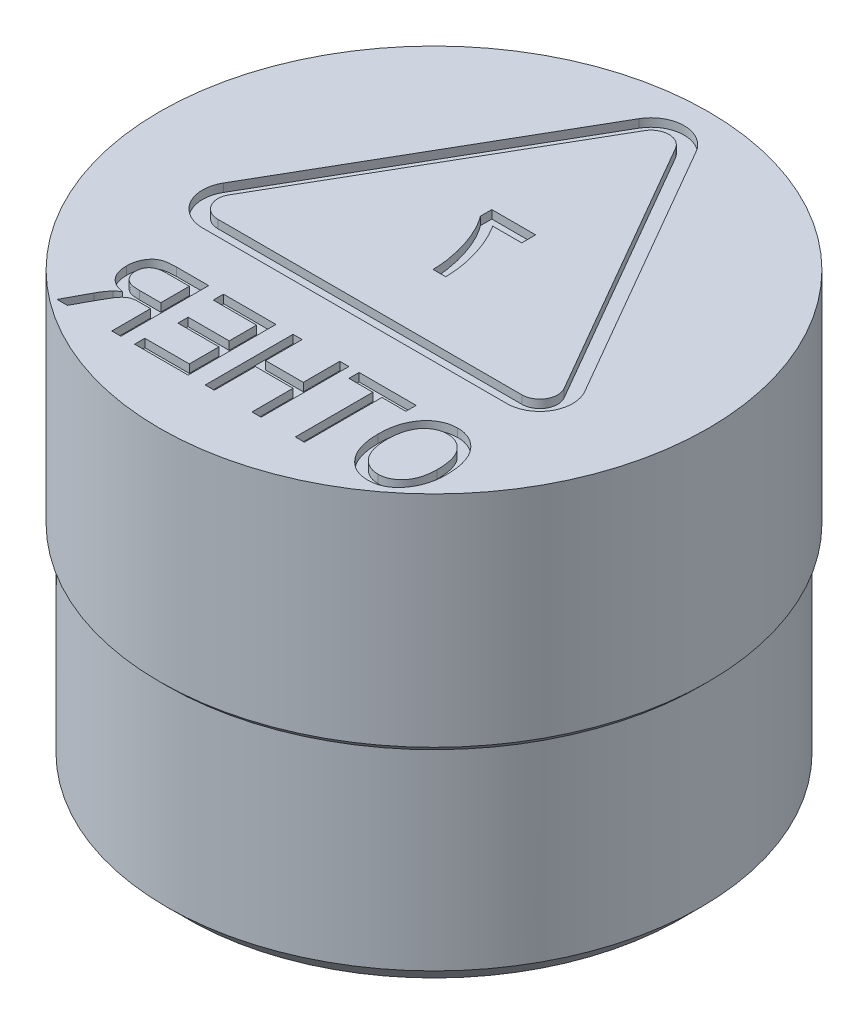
from build123d import *

# Parameters (mm, degrees)
CHAMFER1_SIZE             = 0.76
M6X1_0_TAPPED_HOLE1_D     = 5
M6X1_0_TAPPED_HOLE1_DEPTH = 6
CUT_EXTRUDE2_DEPTH        = 0.3
CUT_EXTRUDE3_DEPTH        = 0.3
CUT_EXTRUDE4_DEPTH        = 0.3


with BuildPart() as part:
    # Sketch1 → Revolve1 (revolve)
    with BuildSketch(Plane.XY, mode=Mode.PRIVATE) as revolve1_sk:
        Polygon((-10, 16), (-10, 8), (-9.745, 7.745), (-9.745, 0), (0, 0), (0, 16), align=None)
    revolve(revolve1_sk.sketch.rotate(Axis((0, 36.769771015, 0), (0, -1, 0)), 270), axis=Axis((0, 36.769771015, 0), (0, -1, 0)))

    # Chamfer1
    chamfer1_edges = [part.edges().sort_by_distance(p)[0] for p in [
        (0, 0, -9.745),
    ]]
    chamfer(chamfer1_edges, length=CHAMFER1_SIZE)

    # M6x1.0 Tapped Hole1
    with Locations(Plane(origin=(0, 0, 0), x_dir=(-1, 0, 0), z_dir=(0, -1, 0))):
        with Locations((0, 0)):
            Hole(M6X1_0_TAPPED_HOLE1_D / 2, depth=M6X1_0_TAPPED_HOLE1_DEPTH)

    # Sketch8 → Cut-Extrude2 (cut)
    with BuildSketch(Plane(origin=(0, 16, 0), x_dir=(1, 0, 0), z_dir=(0, 1, 0))):
        with BuildLine():
            Line((-6.584600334, -1.092146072), (-1.039230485, 8.516792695))
            ThreePointArc((-1.039230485, 8.516792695), (0, 9.116792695), (1.039230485, 8.516792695))
            Line((1.039230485, 8.516792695), (6.585510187, -1.089645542))
            ThreePointArc((6.585510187, -1.089645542), (6.58551035, -2.289645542), (5.546279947, -2.889645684))
            Line((5.546279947, -2.889645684), (-5.54536985, -2.892146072))
            ThreePointArc((-5.54536985, -2.892146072), (-6.584600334, -2.292146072), (-6.584600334, -1.092146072))
        make_face()
        with BuildLine():
            Line((-0.560562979, 8.237716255), (-6.105932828, -1.363069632))
            ThreePointArc((-6.105932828, -1.363069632), (-6.105932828, -2.013069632), (-5.543016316, -2.338069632))
            Line((-5.543016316, -2.338069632), (5.546281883, -2.339646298))
            ThreePointArc((5.546281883, -2.339646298), (6.109198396, -2.014646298), (6.109198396, -1.364646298))
            Line((6.109198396, -1.364646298), (0.565270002, 8.237716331))
            ThreePointArc((0.565270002, 8.237716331), (0.002353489, 8.562716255), (-0.560562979, 8.237716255))
        make_face(mode=Mode.SUBTRACT)
    extrude(amount=-CUT_EXTRUDE2_DEPTH, mode=Mode.SUBTRACT)

    # Sketch12 → Cut-Extrude3 (cut)
    with BuildSketch(Plane(origin=(0, 16, 0), x_dir=(1, 0, 0), z_dir=(0, 1, 0))):
        with BuildLine():
            Line((0.744155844, 2.454545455), (0.744155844, 2.961038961))
            Line((0.744155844, 2.961038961), (-0.853246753, 2.961038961))
            Line((-0.853246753, 2.961038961), (-0.853246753, 2.543425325))
            add(Edge.make_bspline(
                [(-0.853246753, 2.543425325), (-0.836556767, 2.522509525), (-0.802233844, 2.479496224), (-0.754065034, 2.409200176), (-0.703569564, 2.334226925), (-0.654901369, 2.251534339), (-0.604599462, 2.163664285), (-0.555677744, 2.068533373), (-0.504889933, 1.968086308), (-0.43838134, 1.824351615), (-0.358698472, 1.637497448), (-0.275431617, 1.404481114), (-0.203702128, 1.163580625), (-0.14360577, 0.918100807), (-0.096145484, 0.674432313), (-0.061123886, 0.439476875), (-0.039106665, 0.215926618), (-0.03638761, 0.070662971), (-0.035064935, 0)],
                knots=[0, 0, 0, 0, 0.473354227, 0.97345203, 1.507272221, 2.072602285, 2.670769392, 3.298770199, 3.965211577, 4.662431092, 6.101005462, 7.5582634, 9.038592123, 10.547028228, 12.028736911, 13.429840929, 14.749755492, 16, 16, 16, 16], degree=3))
            Line((-0.035064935, 0), (0.432467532, 0))
            add(Edge.make_bspline(
                [(0.432467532, 0), (0.430667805, 0.053797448), (0.427057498, 0.16171677), (0.413800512, 0.323311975), (0.395628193, 0.484931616), (0.371777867, 0.646330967), (0.342713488, 0.80781873), (0.307290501, 0.968978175), (0.266231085, 1.130106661), (0.220564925, 1.290691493), (0.168454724, 1.448942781), (0.113521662, 1.604577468), (0.052962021, 1.755782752), (-0.010785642, 1.903651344), (-0.079543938, 2.047170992), (-0.152966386, 2.186564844), (-0.229205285, 2.322946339), (-0.284476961, 2.410741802), (-0.312053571, 2.454545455)],
                knots=[0, 0, 0, 0, 0.99531935, 1.996640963, 2.997456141, 4.002630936, 5.013275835, 6.031279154, 7.053396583, 8.087948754, 9.118033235, 10.134077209, 11.139644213, 12.129593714, 13.111515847, 14.081722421, 15.042916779, 16, 16, 16, 16], degree=3))
            Line((-0.312053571, 2.454545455), (0.744155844, 2.454545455))
        make_face()
    extrude(amount=-CUT_EXTRUDE3_DEPTH, mode=Mode.SUBTRACT)

    # Sketch13 → Cut-Extrude4 (cut)
    # profile 1 of 5: a face of its own
    with BuildSketch(Plane(origin=(0, 16, 0), x_dir=(1, 0, 0), z_dir=(0, 1, 0))):
        with BuildLine():
            add(Edge.make_bspline(
                [(6.692207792, -6.242207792), (6.6910775, -6.176588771), (6.688876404, -6.048804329), (6.67209816, -5.863017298), (6.643596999, -5.688978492), (6.604452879, -5.526520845), (6.553021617, -5.375936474), (6.490832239, -5.236640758), (6.416541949, -5.109282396), (6.331236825, -4.994419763), (6.238183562, -4.891842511), (6.138016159, -4.802935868), (6.032843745, -4.726906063), (5.92136262, -4.665757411), (5.805008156, -4.616569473), (5.68215357, -4.583647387), (5.554254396, -4.561638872), (5.46697767, -4.559517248), (5.422727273, -4.558441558)],
                knots=[0, 0, 0, 0, 1.331070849, 2.592086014, 3.780305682, 4.906005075, 5.978011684, 7.003908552, 7.995748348, 8.962674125, 9.901370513, 10.800246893, 11.675154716, 12.528146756, 13.374603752, 14.231114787, 15.103152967, 16, 16, 16, 16], degree=3))
            add(Edge.make_bspline(
                [(5.422727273, -4.558441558), (5.393696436, -4.559084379), (5.336358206, -4.560354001), (5.251327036, -4.569914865), (5.168268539, -4.584365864), (5.087255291, -4.606351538), (5.007844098, -4.633360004), (4.930626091, -4.667238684), (4.855548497, -4.707335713), (4.782305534, -4.752376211), (4.712020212, -4.803913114), (4.645240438, -4.861064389), (4.581870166, -4.923595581), (4.522919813, -4.99200095), (4.467407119, -5.065630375), (4.416257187, -5.144992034), (4.368770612, -5.229887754), (4.324735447, -5.319748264), (4.285101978, -5.414652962), (4.250462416, -5.514095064), (4.222390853, -5.618428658), (4.19794645, -5.726631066), (4.180255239, -5.839712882), (4.166332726, -5.956851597), (4.158628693, -6.078683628), (4.157643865, -6.161245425), (4.157142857, -6.203246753)],
                knots=[0, 0, 0, 0, 0.899824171, 1.777224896, 2.649917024, 3.510973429, 4.376801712, 5.248254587, 6.121797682, 7.013780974, 7.911701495, 8.820786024, 9.736582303, 10.668970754, 11.617827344, 12.593151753, 13.593637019, 14.632021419, 15.69381936, 16.780371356, 17.893899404, 19.04171746, 20.217729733, 21.440466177, 22.69789874, 24, 24, 24, 24], degree=3))
            add(Edge.make_bspline(
                [(4.157142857, -6.203246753), (4.158187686, -6.260632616), (4.160233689, -6.373006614), (4.174841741, -6.537596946), (4.201407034, -6.693825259), (4.235562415, -6.842490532), (4.282075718, -6.982429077), (4.338074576, -7.114348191), (4.403768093, -7.238625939), (4.456787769, -7.314779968), (4.483116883, -7.352597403)],
                knots=[0, 0, 0, 0, 1.133525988, 2.219690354, 3.25996653, 4.261750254, 5.229810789, 6.168477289, 7.090481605, 8, 8, 8, 8], degree=3))
            add(Edge.make_bspline(
                [(4.483116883, -7.352597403), (4.513489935, -7.391375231), (4.572857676, -7.467171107), (4.67383455, -7.56738669), (4.781796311, -7.652014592), (4.896550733, -7.722172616), (5.018892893, -7.77530956), (5.147849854, -7.814005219), (5.284019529, -7.837125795), (5.377183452, -7.840061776), (5.424675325, -7.841558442)],
                knots=[0, 0, 0, 0, 1.070119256, 2.09167529, 3.083880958, 4.046692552, 5.007570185, 5.975302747, 6.967876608, 8, 8, 8, 8], degree=3))
            add(Edge.make_bspline(
                [(5.424675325, -7.841558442), (5.472390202, -7.840114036), (5.566033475, -7.837279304), (5.703111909, -7.813344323), (5.832774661, -7.773582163), (5.95572143, -7.718745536), (6.070702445, -7.647116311), (6.178341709, -7.559875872), (6.279323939, -7.457453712), (6.338095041, -7.379511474), (6.368181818, -7.33961039)],
                knots=[0, 0, 0, 0, 1.027712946, 2.016947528, 2.987811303, 3.944031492, 4.90967079, 5.89821231, 6.924028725, 8, 8, 8, 8], degree=3))
            add(Edge.make_bspline(
                [(6.368181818, -7.33961039), (6.394208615, -7.301081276), (6.446108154, -7.224251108), (6.511579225, -7.100928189), (6.567737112, -6.97229526), (6.612865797, -6.83742941), (6.649028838, -6.697114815), (6.674009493, -6.550731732), (6.689182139, -6.398373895), (6.691188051, -6.294840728), (6.692207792, -6.242207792)],
                knots=[0, 0, 0, 0, 0.958933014, 1.912189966, 2.876424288, 3.85247362, 4.843745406, 5.863745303, 6.913996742, 8, 8, 8, 8], degree=3))
        make_face()
        with BuildLine():
            add(Edge.make_bspline(
                [(6.35974026, -6.247402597), (6.358796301, -6.294397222), (6.356961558, -6.385739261), (6.344817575, -6.518836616), (6.323466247, -6.643892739), (6.293590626, -6.760895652), (6.256374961, -6.870188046), (6.209181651, -6.970762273), (6.153883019, -7.063574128), (6.090316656, -7.147887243), (6.020400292, -7.222626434), (5.946894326, -7.28847683), (5.86887831, -7.343011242), (5.788206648, -7.389247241), (5.703109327, -7.424572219), (5.614289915, -7.449004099), (5.521971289, -7.464551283), (5.459153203, -7.466528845), (5.427272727, -7.467532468)],
                knots=[0, 0, 0, 0, 1.312267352, 2.550614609, 3.728111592, 4.851026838, 5.919546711, 6.947055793, 7.94734328, 8.931337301, 9.889295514, 10.801324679, 11.681722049, 12.542374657, 13.393208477, 14.246700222, 15.110192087, 16, 16, 16, 16], degree=3))
            add(Edge.make_bspline(
                [(5.427272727, -7.467532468), (5.394749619, -7.466497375), (5.330439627, -7.464450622), (5.236047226, -7.44930122), (5.145711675, -7.424062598), (5.059928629, -7.387605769), (4.977864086, -7.342219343), (4.899918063, -7.286382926), (4.826368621, -7.220206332), (4.75687244, -7.144506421), (4.693946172, -7.058529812), (4.638254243, -6.96328304), (4.592294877, -6.857853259), (4.555076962, -6.743106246), (4.524790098, -6.619260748), (4.504940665, -6.485572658), (4.49128465, -6.342708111), (4.490179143, -6.244190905), (4.48961039, -6.193506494)],
                knots=[0, 0, 0, 0, 0.878770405, 1.737648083, 2.57658969, 3.407764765, 4.250999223, 5.106523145, 5.993164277, 6.920704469, 7.879005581, 8.867335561, 9.896730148, 10.980825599, 12.124467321, 13.338272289, 14.63061378, 16, 16, 16, 16], degree=3))
            add(Edge.make_bspline(
                [(4.48961039, -6.193506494), (4.48992771, -6.16016304), (4.490552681, -6.094492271), (4.49721645, -5.997177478), (4.508387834, -5.902761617), (4.522787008, -5.81067302), (4.543651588, -5.721899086), (4.566363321, -5.635058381), (4.595172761, -5.551318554), (4.617484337, -5.497081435), (4.628571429, -5.47012987)],
                knots=[0, 0, 0, 0, 1.078644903, 2.124418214, 3.153743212, 4.154196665, 5.137842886, 6.102739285, 7.057211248, 8, 8, 8, 8], degree=3))
            add(Edge.make_bspline(
                [(4.628571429, -5.47012987), (4.647306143, -5.430711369), (4.684328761, -5.352814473), (4.760021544, -5.248576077), (4.847642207, -5.155438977), (4.948803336, -5.07732561), (5.0579499, -5.012543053), (5.174121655, -4.965890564), (5.295616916, -4.93761722), (5.378423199, -4.934192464), (5.42012987, -4.932467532)],
                knots=[0, 0, 0, 0, 1.032714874, 2.040800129, 3.038924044, 4.055125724, 5.060150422, 6.038733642, 7.012177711, 8, 8, 8, 8], degree=3))
            add(Edge.make_bspline(
                [(5.42012987, -4.932467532), (5.453515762, -4.933501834), (5.519328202, -4.935540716), (5.615699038, -4.950569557), (5.707365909, -4.976085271), (5.794402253, -5.011568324), (5.877388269, -5.056232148), (5.955204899, -5.112405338), (6.028653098, -5.178045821), (6.097032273, -5.253940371), (6.160122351, -5.339489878), (6.21283831, -5.43771944), (6.259357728, -5.54544687), (6.29581607, -5.664935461), (6.325314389, -5.794873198), (6.344223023, -5.936157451), (6.358182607, -6.088034), (6.359208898, -6.193037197), (6.35974026, -6.247402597)],
                knots=[0, 0, 0, 0, 0.879508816, 1.733744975, 2.562624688, 3.381316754, 4.205651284, 5.039714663, 5.904114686, 6.796492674, 7.727389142, 8.697387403, 9.727116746, 10.814853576, 11.984051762, 13.234256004, 14.568036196, 16, 16, 16, 16], degree=3))
        make_face(mode=Mode.SUBTRACT)
    # profile 2 of 5: a face of its own
    with BuildSketch(Plane(origin=(0, 16, 0), x_dir=(1, 0, 0), z_dir=(0, 1, 0))):
        Polygon((3.076623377, -7.8), (3.076623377, -4.974025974), (3.949350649, -4.974025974), (3.949350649, -4.6), (1.871428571, -4.6), (1.871428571, -4.974025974), (2.744155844, -4.974025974), (2.744155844, -7.8), align=None)
    # profile 3 of 5: a face of its own
    with BuildSketch(Plane(origin=(0, 16, 0), x_dir=(1, 0, 0), z_dir=(0, 1, 0))):
        Polygon((1.497402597, -7.8), (1.497402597, -4.6), (1.164935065, -4.6), (1.164935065, -5.92987013), (-0.206493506, -5.92987013), (-0.206493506, -4.6), (-0.538961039, -4.6), (-0.538961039, -7.8), (-0.206493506, -7.8), (-0.206493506, -6.303896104), (1.164935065, -6.303896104), (1.164935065, -7.8), align=None)
    # profile 4 of 5: a face of its own
    with BuildSketch(Plane(origin=(0, 16, 0), x_dir=(1, 0, 0), z_dir=(0, 1, 0))):
        Polygon((-1.162337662, -7.8), (-1.162337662, -4.6), (-3.074025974, -4.6), (-3.074025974, -4.974025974), (-1.494805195, -4.974025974), (-1.494805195, -5.971428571), (-2.990909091, -5.971428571), (-2.990909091, -6.345454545), (-1.494805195, -6.345454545), (-1.494805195, -7.425974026), (-3.115584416, -7.425974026), (-3.115584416, -7.8), align=None)
    # profile 5 of 5: a face of its own
    with BuildSketch(Plane(origin=(0, 16, 0), x_dir=(1, 0, 0), z_dir=(0, 1, 0))):
        with BuildLine():
            Line((-3.614285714, -7.8), (-3.614285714, -4.6))
            Line((-3.614285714, -4.6), (-4.78961039, -4.6))
            add(Edge.make_bspline(
                [(-4.78961039, -4.6), (-4.819271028, -4.60017073), (-4.876682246, -4.600501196), (-4.959850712, -4.605255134), (-5.037184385, -4.612292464), (-5.108580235, -4.621649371), (-5.173621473, -4.634621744), (-5.232566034, -4.650358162), (-5.285893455, -4.667923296), (-5.348497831, -4.696897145), (-5.419921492, -4.741838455), (-5.496951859, -4.81030881), (-5.56442418, -4.89510051), (-5.624464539, -4.992522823), (-5.673771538, -5.101905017), (-5.708697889, -5.221192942), (-5.72978224, -5.348819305), (-5.732415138, -5.43671415), (-5.733766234, -5.481818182)],
                knots=[0, 0, 0, 0, 0.957775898, 1.853873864, 2.6892683, 3.465319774, 4.178195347, 4.829309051, 5.435011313, 5.988660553, 7.053440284, 8.147710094, 9.30058322, 10.540256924, 11.835580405, 13.162637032, 14.543981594, 16, 16, 16, 16], degree=3))
            add(Edge.make_bspline(
                [(-5.733766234, -5.481818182), (-5.733059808, -5.511707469), (-5.731679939, -5.570090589), (-5.723321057, -5.655661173), (-5.708795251, -5.736829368), (-5.686580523, -5.813385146), (-5.660816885, -5.88627984), (-5.626985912, -5.954235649), (-5.588171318, -6.018130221), (-5.543057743, -6.077455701), (-5.492596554, -6.132079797), (-5.435964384, -6.181143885), (-5.374262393, -6.225344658), (-5.307009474, -6.264294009), (-5.234621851, -6.298490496), (-5.156243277, -6.325777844), (-5.073095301, -6.349674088), (-5.015258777, -6.360634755), (-4.985714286, -6.366233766)],
                knots=[0, 0, 0, 0, 1.121977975, 2.191573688, 3.224240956, 4.211948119, 5.180998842, 6.122125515, 7.055751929, 7.983633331, 8.914994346, 9.842128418, 10.791356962, 11.759862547, 12.75578979, 13.791489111, 14.871831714, 16, 16, 16, 16], degree=3))
            add(Edge.make_bspline(
                [(-4.985714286, -6.366233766), (-5.007521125, -6.378298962), (-5.049032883, -6.401266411), (-5.10584324, -6.438322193), (-5.15439421, -6.475620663), (-5.181840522, -6.502763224), (-5.194805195, -6.515584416)],
                knots=[0, 0, 0, 0, 1.158843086, 2.205987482, 3.152571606, 4, 4, 4, 4], degree=3))
            add(Edge.make_bspline(
                [(-5.194805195, -6.515584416), (-5.220736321, -6.546884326), (-5.272890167, -6.609836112), (-5.344384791, -6.710267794), (-5.412867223, -6.814744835), (-5.453083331, -6.888239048), (-5.473376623, -6.925324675)],
                knots=[0, 0, 0, 0, 0.982253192, 1.975551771, 2.978451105, 4, 4, 4, 4], degree=3))
            Line((-5.473376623, -6.925324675), (-5.941558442, -7.8))
            Line((-5.941558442, -7.8), (-5.563636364, -7.8))
            Line((-5.563636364, -7.8), (-5.194155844, -7.115584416))
            add(Edge.make_bspline(
                [(-5.194155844, -7.115584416), (-5.176943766, -7.08349307), (-5.14402117, -7.022109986), (-5.095160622, -6.934955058), (-5.049741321, -6.856354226), (-5.007839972, -6.78623083), (-4.968835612, -6.725328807), (-4.933804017, -6.672811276), (-4.901721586, -6.629276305), (-4.863323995, -6.584422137), (-4.818693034, -6.537926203), (-4.765637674, -6.491229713), (-4.712643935, -6.455029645), (-4.658689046, -6.427462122), (-4.599296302, -6.409301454), (-4.532372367, -6.39570796), (-4.454923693, -6.388314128), (-4.400014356, -6.387465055), (-4.370779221, -6.387012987)],
                knots=[0, 0, 0, 0, 1.483643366, 2.83785556, 4.070616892, 5.1822306, 6.165666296, 7.016844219, 7.754091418, 8.367230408, 9.421242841, 10.377779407, 11.241203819, 12.029974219, 12.835959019, 13.762973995, 14.808950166, 16, 16, 16, 16], degree=3))
            Line((-4.370779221, -6.387012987), (-3.946753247, -6.387012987))
            Line((-3.946753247, -6.387012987), (-3.946753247, -7.8))
            Line((-3.946753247, -7.8), (-3.614285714, -7.8))
        make_face()
        with BuildLine():
            Line((-3.946753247, -6.012987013), (-4.726623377, -6.012987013))
            add(Edge.make_bspline(
                [(-4.726623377, -6.012987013), (-4.766687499, -6.01220656), (-4.841771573, -6.010743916), (-4.946814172, -6.001029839), (-5.036471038, -5.983451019), (-5.112416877, -5.957848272), (-5.177176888, -5.923923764), (-5.233558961, -5.881913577), (-5.283013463, -5.831741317), (-5.325079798, -5.773707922), (-5.359861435, -5.70908074), (-5.383336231, -5.638036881), (-5.399269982, -5.562613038), (-5.40061145, -5.510476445), (-5.401298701, -5.483766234)],
                knots=[0, 0, 0, 0, 1.47306528, 2.760668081, 3.873497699, 4.82484281, 5.696997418, 6.550136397, 7.399890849, 8.276969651, 9.17766846, 10.086208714, 11.019541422, 12, 12, 12, 12], degree=3))
            add(Edge.make_bspline(
                [(-5.401298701, -5.483766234), (-5.400698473, -5.464489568), (-5.399528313, -5.426909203), (-5.393371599, -5.372007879), (-5.381355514, -5.320344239), (-5.36550103, -5.271640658), (-5.344185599, -5.226342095), (-5.319294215, -5.18373351), (-5.287946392, -5.1455667), (-5.25383265, -5.109434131), (-5.214353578, -5.077356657), (-5.170265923, -5.049562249), (-5.121578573, -5.026214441), (-5.068758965, -5.006194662), (-5.010735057, -4.992878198), (-4.948866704, -4.981344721), (-4.882384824, -4.974950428), (-4.83659243, -4.974340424), (-4.812987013, -4.974025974)],
                knots=[0, 0, 0, 0, 1.045235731, 2.037714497, 2.988326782, 3.915852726, 4.808207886, 5.697550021, 6.58254782, 7.478674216, 8.387536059, 9.331464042, 10.296946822, 11.310355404, 12.385965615, 13.518246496, 14.720686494, 16, 16, 16, 16], degree=3))
            Line((-4.812987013, -4.974025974), (-3.946753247, -4.974025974))
            Line((-3.946753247, -4.974025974), (-3.946753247, -6.012987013))
        make_face(mode=Mode.SUBTRACT)
    extrude(amount=-CUT_EXTRUDE4_DEPTH, mode=Mode.SUBTRACT)


solid = part.part
